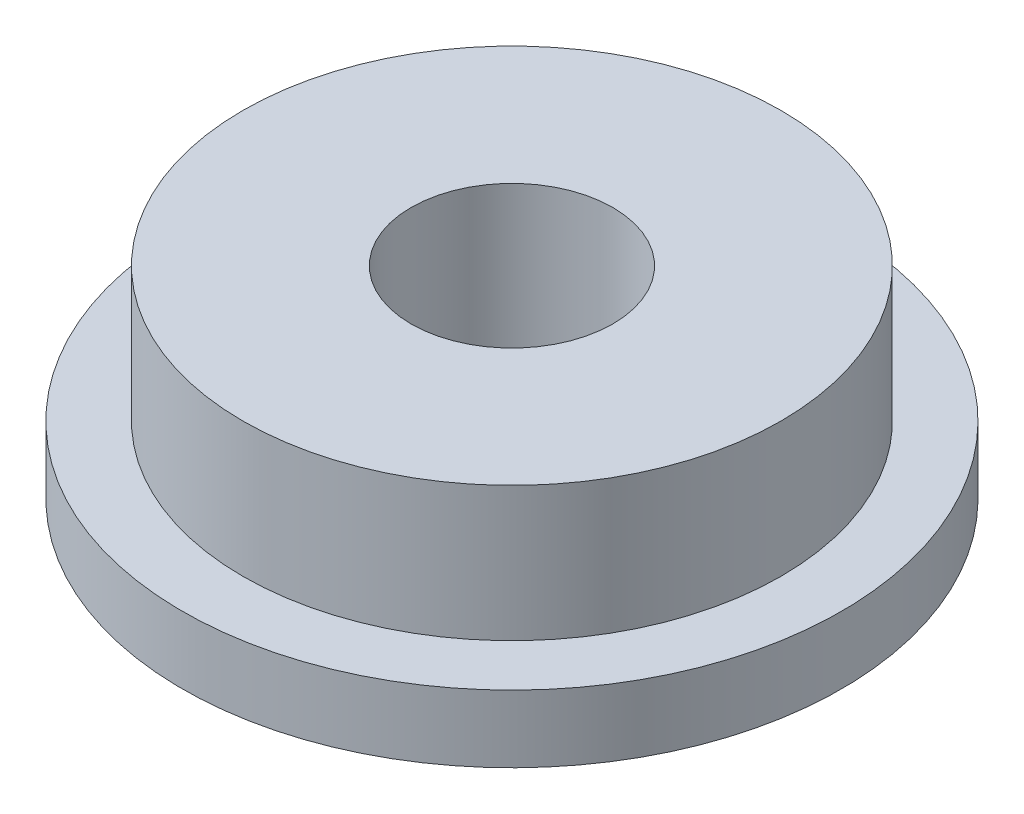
ISO-10303-21;
HEADER;
FILE_DESCRIPTION(('STEP AP214'),'2;1');
FILE_NAME('part.step','',(''),(''),'','','');
FILE_SCHEMA(('AUTOMOTIVE_DESIGN { 1 0 10303 214 1 1 1 1 }'));
ENDSEC;
DATA;
#1=APPLICATION_CONTEXT('core data for automotive mechanical design processes');
#2=APPLICATION_PROTOCOL_DEFINITION('international standard','automotive_design',2000,#1);
#3=PRODUCT_CONTEXT('',#1,'mechanical');
#4=PRODUCT('Part','Part','',(#3));
#5=PRODUCT_RELATED_PRODUCT_CATEGORY('part','',(#4));
#6=PRODUCT_DEFINITION_FORMATION('','',#4);
#7=PRODUCT_DEFINITION_CONTEXT('part definition',#1,'design');
#8=PRODUCT_DEFINITION('design','',#6,#7);
#9=PRODUCT_DEFINITION_SHAPE('','',#8);
#10=(LENGTH_UNIT() NAMED_UNIT(*) SI_UNIT(.MILLI.,.METRE.));
#11=(NAMED_UNIT(*) PLANE_ANGLE_UNIT() SI_UNIT($,.RADIAN.));
#12=(NAMED_UNIT(*) SI_UNIT($,.STERADIAN.) SOLID_ANGLE_UNIT());
#13=UNCERTAINTY_MEASURE_WITH_UNIT(LENGTH_MEASURE(1.E-05),#10,'distance_accuracy_value','');
#14=(GEOMETRIC_REPRESENTATION_CONTEXT(3) GLOBAL_UNCERTAINTY_ASSIGNED_CONTEXT((#13)) GLOBAL_UNIT_ASSIGNED_CONTEXT((#10,
#11,#12)) REPRESENTATION_CONTEXT('',''));
#15=CARTESIAN_POINT('',(0.,0.,0.));
#16=DIRECTION('',(0.,0.,1.));
#17=DIRECTION('',(1.,0.,0.));
#18=AXIS2_PLACEMENT_3D('',#15,#16,#17);
#19=CARTESIAN_POINT('',(0.,25.2722865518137,0.));
#20=DIRECTION('',(0.,1.,0.));
#21=DIRECTION('',(-1.,0.,0.));
#22=AXIS2_PLACEMENT_3D('',#19,#20,#21);
#23=CYLINDRICAL_SURFACE('',#22,2.);
#24=CARTESIAN_POINT('',(0.,1.,0.));
#25=DIRECTION('',(0.,1.,0.));
#26=DIRECTION('',(-1.,0.,0.));
#27=AXIS2_PLACEMENT_3D('',#24,#25,#26);
#28=CIRCLE('',#27,2.00000000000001);
#29=CARTESIAN_POINT('',(-2.,1.,0.));
#30=VERTEX_POINT('',#29);
#31=EDGE_CURVE('E10',#30,#30,#28,.T.);
#32=ORIENTED_EDGE('',*,*,#31,.F.);
#33=EDGE_LOOP('',(#32));
#34=FACE_BOUND('',#33,.T.);
#35=CARTESIAN_POINT('',(0.,0.,0.));
#36=DIRECTION('',(0.,1.,0.));
#37=DIRECTION('',(-1.,0.,0.));
#38=AXIS2_PLACEMENT_3D('',#35,#36,#37);
#39=CIRCLE('',#38,2.);
#40=CARTESIAN_POINT('',(-2.,0.,0.));
#41=VERTEX_POINT('',#40);
#42=EDGE_CURVE('E64',#41,#41,#39,.T.);
#43=ORIENTED_EDGE('',*,*,#42,.T.);
#44=EDGE_LOOP('',(#43));
#45=FACE_BOUND('',#44,.T.);
#46=ADVANCED_FACE('F37',(#34,#45),#23,.T.);
#47=CARTESIAN_POINT('',(0.750000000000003,1.,0.));
#48=DIRECTION('',(0.,-1.,0.));
#49=DIRECTION('',(1.,0.,0.));
#50=AXIS2_PLACEMENT_3D('',#47,#48,#49);
#51=PLANE('',#50);
#52=CARTESIAN_POINT('',(0.,1.,0.));
#53=DIRECTION('',(0.,1.,0.));
#54=DIRECTION('',(-1.,0.,0.));
#55=AXIS2_PLACEMENT_3D('',#52,#53,#54);
#56=CIRCLE('',#55,0.75);
#57=CARTESIAN_POINT('',(-0.749999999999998,1.,0.));
#58=VERTEX_POINT('',#57);
#59=EDGE_CURVE('E44',#58,#58,#56,.T.);
#60=ORIENTED_EDGE('',*,*,#59,.F.);
#61=EDGE_LOOP('',(#60));
#62=FACE_BOUND('',#61,.T.);
#63=ORIENTED_EDGE('',*,*,#31,.T.);
#64=EDGE_LOOP('',(#63));
#65=FACE_BOUND('',#64,.T.);
#66=ADVANCED_FACE('F90',(#62,#65),#51,.F.);
#67=CARTESIAN_POINT('',(0.,25.2722865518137,0.));
#68=DIRECTION('',(0.,1.,0.));
#69=DIRECTION('',(-1.,0.,0.));
#70=AXIS2_PLACEMENT_3D('',#67,#68,#69);
#71=CYLINDRICAL_SURFACE('',#70,0.75);
#72=CARTESIAN_POINT('',(0.,-0.5,0.));
#73=DIRECTION('',(0.,1.,0.));
#74=DIRECTION('',(-1.,0.,0.));
#75=AXIS2_PLACEMENT_3D('',#72,#73,#74);
#76=CIRCLE('',#75,0.75);
#77=CARTESIAN_POINT('',(-0.749999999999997,-0.500000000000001,0.));
#78=VERTEX_POINT('',#77);
#79=EDGE_CURVE('E49',#78,#78,#76,.T.);
#80=ORIENTED_EDGE('',*,*,#79,.F.);
#81=EDGE_LOOP('',(#80));
#82=FACE_BOUND('',#81,.T.);
#83=ORIENTED_EDGE('',*,*,#59,.T.);
#84=EDGE_LOOP('',(#83));
#85=FACE_BOUND('',#84,.T.);
#86=ADVANCED_FACE('F85',(#82,#85),#71,.F.);
#87=CARTESIAN_POINT('',(2.45,-0.5,0.));
#88=DIRECTION('',(0.,1.,0.));
#89=DIRECTION('',(-1.,0.,0.));
#90=AXIS2_PLACEMENT_3D('',#87,#88,#89);
#91=PLANE('',#90);
#92=CARTESIAN_POINT('',(0.,-0.5,0.));
#93=DIRECTION('',(0.,1.,0.));
#94=DIRECTION('',(-1.,0.,0.));
#95=AXIS2_PLACEMENT_3D('',#92,#93,#94);
#96=CIRCLE('',#95,2.45);
#97=CARTESIAN_POINT('',(-2.44999999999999,-0.500000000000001,0.));
#98=VERTEX_POINT('',#97);
#99=EDGE_CURVE('E54',#98,#98,#96,.T.);
#100=ORIENTED_EDGE('',*,*,#99,.F.);
#101=EDGE_LOOP('',(#100));
#102=FACE_BOUND('',#101,.T.);
#103=ORIENTED_EDGE('',*,*,#79,.T.);
#104=EDGE_LOOP('',(#103));
#105=FACE_BOUND('',#104,.T.);
#106=ADVANCED_FACE('F79',(#102,#105),#91,.F.);
#107=CARTESIAN_POINT('',(0.,25.2722865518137,0.));
#108=DIRECTION('',(0.,1.,0.));
#109=DIRECTION('',(-1.,0.,0.));
#110=AXIS2_PLACEMENT_3D('',#107,#108,#109);
#111=CYLINDRICAL_SURFACE('',#110,2.44999999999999);
#112=CARTESIAN_POINT('',(0.,0.,0.));
#113=DIRECTION('',(0.,1.,0.));
#114=DIRECTION('',(-1.,0.,0.));
#115=AXIS2_PLACEMENT_3D('',#112,#113,#114);
#116=CIRCLE('',#115,2.44999999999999);
#117=CARTESIAN_POINT('',(-2.44999999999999,0.,0.));
#118=VERTEX_POINT('',#117);
#119=EDGE_CURVE('E60',#118,#118,#116,.T.);
#120=ORIENTED_EDGE('',*,*,#119,.F.);
#121=EDGE_LOOP('',(#120));
#122=FACE_BOUND('',#121,.T.);
#123=ORIENTED_EDGE('',*,*,#99,.T.);
#124=EDGE_LOOP('',(#123));
#125=FACE_BOUND('',#124,.T.);
#126=ADVANCED_FACE('F73',(#122,#125),#111,.T.);
#127=CARTESIAN_POINT('',(2.,0.,0.));
#128=DIRECTION('',(0.,-1.,0.));
#129=DIRECTION('',(1.,0.,0.));
#130=AXIS2_PLACEMENT_3D('',#127,#128,#129);
#131=PLANE('',#130);
#132=ORIENTED_EDGE('',*,*,#42,.F.);
#133=EDGE_LOOP('',(#132));
#134=FACE_BOUND('',#133,.T.);
#135=ORIENTED_EDGE('',*,*,#119,.T.);
#136=EDGE_LOOP('',(#135));
#137=FACE_BOUND('',#136,.T.);
#138=ADVANCED_FACE('F70',(#134,#137),#131,.F.);
#139=CLOSED_SHELL('',(#46,#66,#86,#106,#126,#138));
#140=MANIFOLD_SOLID_BREP('B2',#139);
#141=ADVANCED_BREP_SHAPE_REPRESENTATION('',(#18,#140),#14);
#142=SHAPE_DEFINITION_REPRESENTATION(#9,#141);
ENDSEC;
END-ISO-10303-21;
